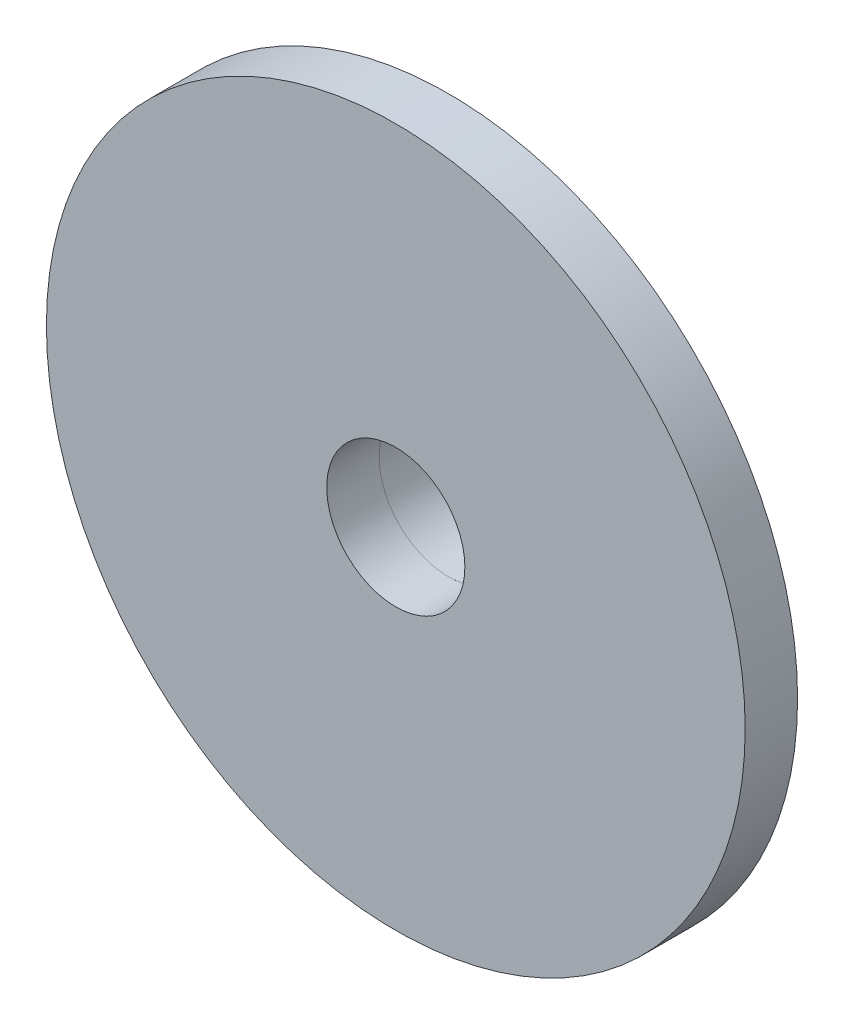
from build123d import *

# Parameters (mm, degrees)
ESQUISSE1_R      = 6.5
ESQUISSE1_R_2    = 2
EXTRUSION1_DEPTH = 1.5
ESQUISSE3_R      = 10
ESQUISSE3_R_2    = 1.976980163
EXTRUSION2_DEPTH = 1.5


with BuildPart() as part:
    # Esquisse1 → Extrusion1 (new body)
    with BuildSketch(Plane.XY):
        Circle(ESQUISSE1_R)
        Circle(ESQUISSE1_R_2, mode=Mode.SUBTRACT)
    extrude(amount=EXTRUSION1_DEPTH)

    # Esquisse3 → Extrusion2 (add)
    with BuildSketch(Plane.XY.offset(1.5)):
        Circle(ESQUISSE3_R)
        Circle(ESQUISSE3_R_2, mode=Mode.SUBTRACT)
    extrude(amount=EXTRUSION2_DEPTH)


solid = part.part
